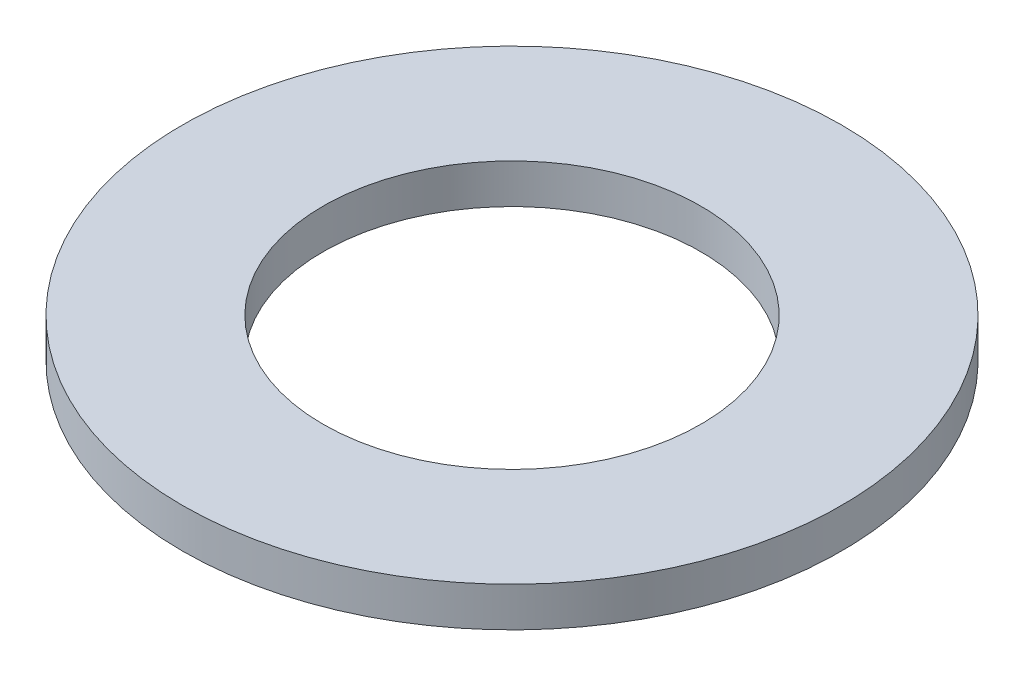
ISO-10303-21;
HEADER;
FILE_DESCRIPTION(('STEP AP214'),'2;1');
FILE_NAME('part.step','',(''),(''),'','','');
FILE_SCHEMA(('AUTOMOTIVE_DESIGN { 1 0 10303 214 1 1 1 1 }'));
ENDSEC;
DATA;
#1=APPLICATION_CONTEXT('core data for automotive mechanical design processes');
#2=APPLICATION_PROTOCOL_DEFINITION('international standard','automotive_design',2000,#1);
#3=PRODUCT_CONTEXT('',#1,'mechanical');
#4=PRODUCT('Part','Part','',(#3));
#5=PRODUCT_RELATED_PRODUCT_CATEGORY('part','',(#4));
#6=PRODUCT_DEFINITION_FORMATION('','',#4);
#7=PRODUCT_DEFINITION_CONTEXT('part definition',#1,'design');
#8=PRODUCT_DEFINITION('design','',#6,#7);
#9=PRODUCT_DEFINITION_SHAPE('','',#8);
#10=(LENGTH_UNIT() NAMED_UNIT(*) SI_UNIT(.MILLI.,.METRE.));
#11=(NAMED_UNIT(*) PLANE_ANGLE_UNIT() SI_UNIT($,.RADIAN.));
#12=(NAMED_UNIT(*) SI_UNIT($,.STERADIAN.) SOLID_ANGLE_UNIT());
#13=UNCERTAINTY_MEASURE_WITH_UNIT(LENGTH_MEASURE(1.E-05),#10,'distance_accuracy_value','');
#14=(GEOMETRIC_REPRESENTATION_CONTEXT(3) GLOBAL_UNCERTAINTY_ASSIGNED_CONTEXT((#13)) GLOBAL_UNIT_ASSIGNED_CONTEXT((#10,
#11,#12)) REPRESENTATION_CONTEXT('',''));
#15=CARTESIAN_POINT('',(0.,0.,0.));
#16=DIRECTION('',(0.,0.,1.));
#17=DIRECTION('',(1.,0.,0.));
#18=AXIS2_PLACEMENT_3D('',#15,#16,#17);
#19=CARTESIAN_POINT('',(0.,0.45,0.));
#20=DIRECTION('',(0.,1.,0.));
#21=DIRECTION('',(0.,0.,1.));
#22=AXIS2_PLACEMENT_3D('',#19,#20,#21);
#23=PLANE('',#22);
#24=CARTESIAN_POINT('',(0.,0.45,0.));
#25=DIRECTION('',(0.,1.,0.));
#26=DIRECTION('',(0.,0.,1.));
#27=AXIS2_PLACEMENT_3D('',#24,#25,#26);
#28=CIRCLE('',#27,3.75);
#29=CARTESIAN_POINT('',(0.,0.45,3.75));
#30=VERTEX_POINT('',#29);
#31=EDGE_CURVE('E10',#30,#30,#28,.T.);
#32=ORIENTED_EDGE('',*,*,#31,.T.);
#33=EDGE_LOOP('',(#32));
#34=FACE_BOUND('',#33,.T.);
#35=CARTESIAN_POINT('',(0.,0.45,0.));
#36=DIRECTION('',(0.,1.,0.));
#37=DIRECTION('',(0.,0.,1.));
#38=AXIS2_PLACEMENT_3D('',#35,#36,#37);
#39=CIRCLE('',#38,2.15);
#40=CARTESIAN_POINT('',(0.,0.45,2.15));
#41=VERTEX_POINT('',#40);
#42=EDGE_CURVE('E42',#41,#41,#39,.T.);
#43=ORIENTED_EDGE('',*,*,#42,.F.);
#44=EDGE_LOOP('',(#43));
#45=FACE_BOUND('',#44,.T.);
#46=ADVANCED_FACE('F31',(#34,#45),#23,.T.);
#47=CARTESIAN_POINT('',(0.,0.,0.));
#48=DIRECTION('',(0.,1.,0.));
#49=DIRECTION('',(0.,0.,1.));
#50=AXIS2_PLACEMENT_3D('',#47,#48,#49);
#51=PLANE('',#50);
#52=CARTESIAN_POINT('',(0.,0.,0.));
#53=DIRECTION('',(0.,1.,0.));
#54=DIRECTION('',(0.,0.,1.));
#55=AXIS2_PLACEMENT_3D('',#52,#53,#54);
#56=CIRCLE('',#55,3.75);
#57=CARTESIAN_POINT('',(0.,0.,3.75));
#58=VERTEX_POINT('',#57);
#59=EDGE_CURVE('E35',#58,#58,#56,.T.);
#60=ORIENTED_EDGE('',*,*,#59,.F.);
#61=EDGE_LOOP('',(#60));
#62=FACE_BOUND('',#61,.T.);
#63=CARTESIAN_POINT('',(0.,0.,0.));
#64=DIRECTION('',(0.,1.,0.));
#65=DIRECTION('',(0.,0.,1.));
#66=AXIS2_PLACEMENT_3D('',#63,#64,#65);
#67=CIRCLE('',#66,2.15);
#68=CARTESIAN_POINT('',(0.,0.,2.15));
#69=VERTEX_POINT('',#68);
#70=EDGE_CURVE('E44',#69,#69,#67,.T.);
#71=ORIENTED_EDGE('',*,*,#70,.T.);
#72=EDGE_LOOP('',(#71));
#73=FACE_BOUND('',#72,.T.);
#74=ADVANCED_FACE('F54',(#62,#73),#51,.F.);
#75=CARTESIAN_POINT('',(0.,0.45,0.));
#76=DIRECTION('',(0.,-1.,0.));
#77=DIRECTION('',(0.,0.,-1.));
#78=AXIS2_PLACEMENT_3D('',#75,#76,#77);
#79=CYLINDRICAL_SURFACE('',#78,3.75);
#80=ORIENTED_EDGE('',*,*,#31,.F.);
#81=EDGE_LOOP('',(#80));
#82=FACE_BOUND('',#81,.T.);
#83=ORIENTED_EDGE('',*,*,#59,.T.);
#84=EDGE_LOOP('',(#83));
#85=FACE_BOUND('',#84,.T.);
#86=ADVANCED_FACE('F33',(#82,#85),#79,.T.);
#87=CARTESIAN_POINT('',(0.,0.45,0.));
#88=DIRECTION('',(0.,-1.,0.));
#89=DIRECTION('',(0.,0.,-1.));
#90=AXIS2_PLACEMENT_3D('',#87,#88,#89);
#91=CYLINDRICAL_SURFACE('',#90,2.15);
#92=ORIENTED_EDGE('',*,*,#42,.T.);
#93=EDGE_LOOP('',(#92));
#94=FACE_BOUND('',#93,.T.);
#95=ORIENTED_EDGE('',*,*,#70,.F.);
#96=EDGE_LOOP('',(#95));
#97=FACE_BOUND('',#96,.T.);
#98=ADVANCED_FACE('F50',(#94,#97),#91,.F.);
#99=CLOSED_SHELL('',(#46,#74,#86,#98));
#100=MANIFOLD_SOLID_BREP('B2',#99);
#101=ADVANCED_BREP_SHAPE_REPRESENTATION('',(#18,#100),#14);
#102=SHAPE_DEFINITION_REPRESENTATION(#9,#101);
ENDSEC;
END-ISO-10303-21;
